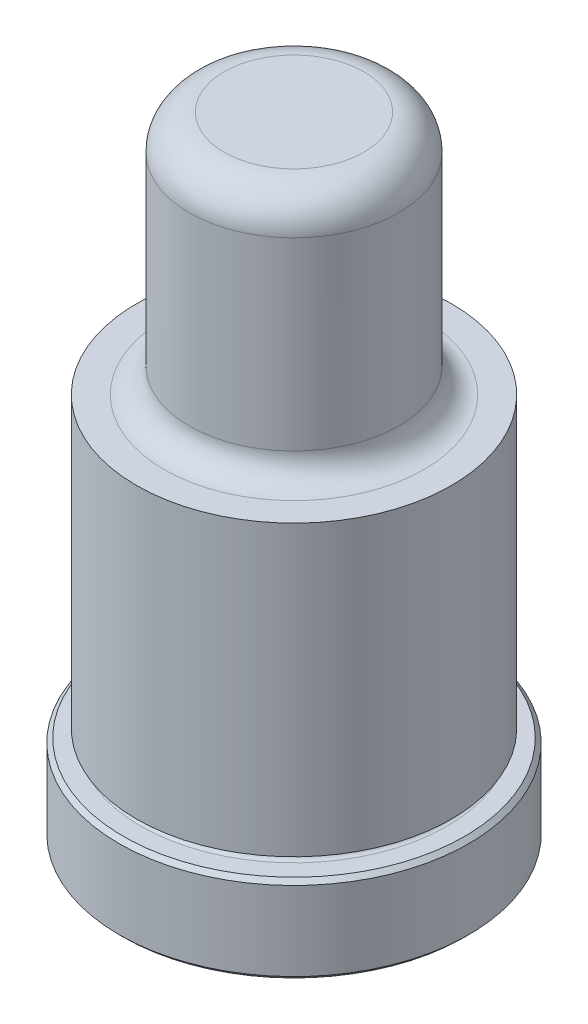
ISO-10303-21;
HEADER;
FILE_DESCRIPTION(('STEP AP214'),'2;1');
FILE_NAME('part.step','',(''),(''),'','','');
FILE_SCHEMA(('AUTOMOTIVE_DESIGN { 1 0 10303 214 1 1 1 1 }'));
ENDSEC;
DATA;
#1=APPLICATION_CONTEXT('core data for automotive mechanical design processes');
#2=APPLICATION_PROTOCOL_DEFINITION('international standard','automotive_design',2000,#1);
#3=PRODUCT_CONTEXT('',#1,'mechanical');
#4=PRODUCT('Part','Part','',(#3));
#5=PRODUCT_RELATED_PRODUCT_CATEGORY('part','',(#4));
#6=PRODUCT_DEFINITION_FORMATION('','',#4);
#7=PRODUCT_DEFINITION_CONTEXT('part definition',#1,'design');
#8=PRODUCT_DEFINITION('design','',#6,#7);
#9=PRODUCT_DEFINITION_SHAPE('','',#8);
#10=(LENGTH_UNIT() NAMED_UNIT(*) SI_UNIT(.MILLI.,.METRE.));
#11=(NAMED_UNIT(*) PLANE_ANGLE_UNIT() SI_UNIT($,.RADIAN.));
#12=(NAMED_UNIT(*) SI_UNIT($,.STERADIAN.) SOLID_ANGLE_UNIT());
#13=UNCERTAINTY_MEASURE_WITH_UNIT(LENGTH_MEASURE(1.E-05),#10,'distance_accuracy_value','');
#14=(GEOMETRIC_REPRESENTATION_CONTEXT(3) GLOBAL_UNCERTAINTY_ASSIGNED_CONTEXT((#13)) GLOBAL_UNIT_ASSIGNED_CONTEXT((#10,
#11,#12)) REPRESENTATION_CONTEXT('',''));
#15=CARTESIAN_POINT('',(0.,0.,0.));
#16=DIRECTION('',(0.,0.,1.));
#17=DIRECTION('',(1.,0.,0.));
#18=AXIS2_PLACEMENT_3D('',#15,#16,#17);
#19=CARTESIAN_POINT('',(0.,0.,0.));
#20=DIRECTION('',(0.,1.,0.));
#21=DIRECTION('',(0.,0.,1.));
#22=AXIS2_PLACEMENT_3D('',#19,#20,#21);
#23=PLANE('',#22);
#24=CARTESIAN_POINT('',(0.,0.,0.));
#25=DIRECTION('',(0.,1.,0.));
#26=DIRECTION('',(0.,0.,1.));
#27=AXIS2_PLACEMENT_3D('',#24,#25,#26);
#28=CIRCLE('',#27,15.494);
#29=CARTESIAN_POINT('',(0.,0.,15.494));
#30=VERTEX_POINT('',#29);
#31=EDGE_CURVE('E46',#30,#30,#28,.F.);
#32=ORIENTED_EDGE('',*,*,#31,.T.);
#33=EDGE_LOOP('',(#32));
#34=FACE_BOUND('',#33,.T.);
#35=ADVANCED_FACE('F31',(#34),#23,.F.);
#36=CARTESIAN_POINT('',(0.,0.,0.));
#37=DIRECTION('',(0.,1.,0.));
#38=DIRECTION('',(0.,0.,1.));
#39=AXIS2_PLACEMENT_3D('',#36,#37,#38);
#40=CYLINDRICAL_SURFACE('',#39,15.875);
#41=CARTESIAN_POINT('',(0.,0.381000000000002,0.));
#42=DIRECTION('',(0.,1.,0.));
#43=DIRECTION('',(0.,0.,1.));
#44=AXIS2_PLACEMENT_3D('',#41,#42,#43);
#45=CIRCLE('',#44,15.875);
#46=CARTESIAN_POINT('',(0.,0.381,15.875));
#47=VERTEX_POINT('',#46);
#48=EDGE_CURVE('E51',#47,#47,#45,.T.);
#49=ORIENTED_EDGE('',*,*,#48,.T.);
#50=EDGE_LOOP('',(#49));
#51=FACE_BOUND('',#50,.T.);
#52=CARTESIAN_POINT('',(0.,7.5438,0.));
#53=DIRECTION('',(0.,-1.,0.));
#54=DIRECTION('',(0.,0.,-1.));
#55=AXIS2_PLACEMENT_3D('',#52,#53,#54);
#56=CIRCLE('',#55,15.875);
#57=CARTESIAN_POINT('',(0.,7.5438,-15.875));
#58=VERTEX_POINT('',#57);
#59=EDGE_CURVE('E54',#58,#58,#56,.T.);
#60=ORIENTED_EDGE('',*,*,#59,.T.);
#61=EDGE_LOOP('',(#60));
#62=FACE_BOUND('',#61,.T.);
#63=ADVANCED_FACE('F110',(#51,#62),#40,.T.);
#64=CARTESIAN_POINT('',(0.,7.9248,-15.875));
#65=DIRECTION('',(0.,-1.,0.));
#66=DIRECTION('',(0.,0.,-1.));
#67=AXIS2_PLACEMENT_3D('',#64,#65,#66);
#68=PLANE('',#67);
#69=CARTESIAN_POINT('',(0.,7.9248,0.));
#70=DIRECTION('',(0.,-1.,0.));
#71=DIRECTION('',(0.,0.,-1.));
#72=AXIS2_PLACEMENT_3D('',#69,#70,#71);
#73=CIRCLE('',#72,15.494);
#74=CARTESIAN_POINT('',(0.,7.9248,-15.494));
#75=VERTEX_POINT('',#74);
#76=EDGE_CURVE('E42',#75,#75,#73,.F.);
#77=ORIENTED_EDGE('',*,*,#76,.T.);
#78=EDGE_LOOP('',(#77));
#79=FACE_BOUND('',#78,.T.);
#80=CARTESIAN_POINT('',(0.,7.9248,0.));
#81=DIRECTION('',(0.,1.,0.));
#82=DIRECTION('',(0.,0.,1.));
#83=AXIS2_PLACEMENT_3D('',#80,#81,#82);
#84=CIRCLE('',#83,13.8938);
#85=CARTESIAN_POINT('',(0.,7.9248,13.8938));
#86=VERTEX_POINT('',#85);
#87=EDGE_CURVE('E57',#86,#86,#84,.T.);
#88=ORIENTED_EDGE('',*,*,#87,.F.);
#89=EDGE_LOOP('',(#88));
#90=FACE_BOUND('',#89,.T.);
#91=ADVANCED_FACE('F105',(#79,#90),#68,.F.);
#92=CARTESIAN_POINT('',(0.,8.3058,0.));
#93=DIRECTION('',(0.,1.,0.));
#94=DIRECTION('',(0.,0.,1.));
#95=AXIS2_PLACEMENT_3D('',#92,#93,#94);
#96=TOROIDAL_SURFACE('',#95,13.8938,0.381000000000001);
#97=CARTESIAN_POINT('',(0.,8.68680000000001,0.));
#98=DIRECTION('',(0.,1.,0.));
#99=DIRECTION('',(0.,0.,1.));
#100=AXIS2_PLACEMENT_3D('',#97,#98,#99);
#101=CIRCLE('',#100,13.8938);
#102=CARTESIAN_POINT('',(0.,8.6868,13.8938));
#103=VERTEX_POINT('',#102);
#104=EDGE_CURVE('E60',#103,#103,#101,.T.);
#105=ORIENTED_EDGE('',*,*,#104,.F.);
#106=EDGE_LOOP('',(#105));
#107=FACE_BOUND('',#106,.T.);
#108=ORIENTED_EDGE('',*,*,#87,.T.);
#109=EDGE_LOOP('',(#108));
#110=FACE_BOUND('',#109,.T.);
#111=ADVANCED_FACE('F99',(#107,#110),#96,.F.);
#112=CARTESIAN_POINT('',(0.,8.68680000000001,-13.8938));
#113=DIRECTION('',(0.,1.,0.));
#114=DIRECTION('',(0.,0.,1.));
#115=AXIS2_PLACEMENT_3D('',#112,#113,#114);
#116=PLANE('',#115);
#117=CARTESIAN_POINT('',(0.,8.6868,0.));
#118=DIRECTION('',(0.,1.,0.));
#119=DIRECTION('',(0.,0.,1.));
#120=AXIS2_PLACEMENT_3D('',#117,#118,#119);
#121=CIRCLE('',#120,14.3002);
#122=CARTESIAN_POINT('',(0.,8.6868,14.3002));
#123=VERTEX_POINT('',#122);
#124=EDGE_CURVE('E63',#123,#123,#121,.T.);
#125=ORIENTED_EDGE('',*,*,#124,.F.);
#126=EDGE_LOOP('',(#125));
#127=FACE_BOUND('',#126,.T.);
#128=ORIENTED_EDGE('',*,*,#104,.T.);
#129=EDGE_LOOP('',(#128));
#130=FACE_BOUND('',#129,.T.);
#131=ADVANCED_FACE('F93',(#127,#130),#116,.F.);
#132=CARTESIAN_POINT('',(0.,0.,0.));
#133=DIRECTION('',(0.,1.,0.));
#134=DIRECTION('',(0.,0.,1.));
#135=AXIS2_PLACEMENT_3D('',#132,#133,#134);
#136=CYLINDRICAL_SURFACE('',#135,14.3002);
#137=CARTESIAN_POINT('',(0.,34.925,0.));
#138=DIRECTION('',(0.,1.,0.));
#139=DIRECTION('',(0.,0.,1.));
#140=AXIS2_PLACEMENT_3D('',#137,#138,#139);
#141=CIRCLE('',#140,14.3002);
#142=CARTESIAN_POINT('',(0.,34.925,14.3002));
#143=VERTEX_POINT('',#142);
#144=EDGE_CURVE('E66',#143,#143,#141,.T.);
#145=ORIENTED_EDGE('',*,*,#144,.F.);
#146=EDGE_LOOP('',(#145));
#147=FACE_BOUND('',#146,.T.);
#148=ORIENTED_EDGE('',*,*,#124,.T.);
#149=EDGE_LOOP('',(#148));
#150=FACE_BOUND('',#149,.T.);
#151=ADVANCED_FACE('F87',(#147,#150),#136,.T.);
#152=CARTESIAN_POINT('',(0.,34.925,-14.3002));
#153=DIRECTION('',(0.,-1.,0.));
#154=DIRECTION('',(0.,0.,-1.));
#155=AXIS2_PLACEMENT_3D('',#152,#153,#154);
#156=PLANE('',#155);
#157=CARTESIAN_POINT('',(0.,34.925,0.));
#158=DIRECTION('',(0.,1.,0.));
#159=DIRECTION('',(0.,0.,1.));
#160=AXIS2_PLACEMENT_3D('',#157,#158,#159);
#161=CIRCLE('',#160,11.7983);
#162=CARTESIAN_POINT('',(0.,34.925,11.7983));
#163=VERTEX_POINT('',#162);
#164=EDGE_CURVE('E69',#163,#163,#161,.T.);
#165=ORIENTED_EDGE('',*,*,#164,.F.);
#166=EDGE_LOOP('',(#165));
#167=FACE_BOUND('',#166,.T.);
#168=ORIENTED_EDGE('',*,*,#144,.T.);
#169=EDGE_LOOP('',(#168));
#170=FACE_BOUND('',#169,.T.);
#171=ADVANCED_FACE('F81',(#167,#170),#156,.F.);
#172=CARTESIAN_POINT('',(0.,37.211,0.));
#173=DIRECTION('',(0.,1.,0.));
#174=DIRECTION('',(0.,0.,1.));
#175=AXIS2_PLACEMENT_3D('',#172,#173,#174);
#176=TOROIDAL_SURFACE('',#175,11.7983,2.28599999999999);
#177=CARTESIAN_POINT('',(0.,37.211,0.));
#178=DIRECTION('',(0.,1.,0.));
#179=DIRECTION('',(0.,0.,1.));
#180=AXIS2_PLACEMENT_3D('',#177,#178,#179);
#181=CIRCLE('',#180,9.51230000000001);
#182=CARTESIAN_POINT('',(0.,37.211,9.51230000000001));
#183=VERTEX_POINT('',#182);
#184=EDGE_CURVE('E72',#183,#183,#181,.T.);
#185=ORIENTED_EDGE('',*,*,#184,.F.);
#186=EDGE_LOOP('',(#185));
#187=FACE_BOUND('',#186,.T.);
#188=ORIENTED_EDGE('',*,*,#164,.T.);
#189=EDGE_LOOP('',(#188));
#190=FACE_BOUND('',#189,.T.);
#191=ADVANCED_FACE('F78',(#187,#190),#176,.F.);
#192=CARTESIAN_POINT('',(0.,0.,0.));
#193=DIRECTION('',(0.,1.,0.));
#194=DIRECTION('',(0.,0.,1.));
#195=AXIS2_PLACEMENT_3D('',#192,#193,#194);
#196=CYLINDRICAL_SURFACE('',#195,9.51230000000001);
#197=CARTESIAN_POINT('',(0.,53.975,0.));
#198=DIRECTION('',(0.,-1.,0.));
#199=DIRECTION('',(0.,0.,-1.));
#200=AXIS2_PLACEMENT_3D('',#197,#198,#199);
#201=CIRCLE('',#200,9.51230000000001);
#202=CARTESIAN_POINT('',(0.,53.975,-9.5123));
#203=VERTEX_POINT('',#202);
#204=EDGE_CURVE('E10',#203,#203,#201,.T.);
#205=ORIENTED_EDGE('',*,*,#204,.T.);
#206=EDGE_LOOP('',(#205));
#207=FACE_BOUND('',#206,.T.);
#208=ORIENTED_EDGE('',*,*,#184,.T.);
#209=EDGE_LOOP('',(#208));
#210=FACE_BOUND('',#209,.T.);
#211=ADVANCED_FACE('F76',(#207,#210),#196,.T.);
#212=CARTESIAN_POINT('',(0.,57.15,-9.5123));
#213=DIRECTION('',(0.,-1.,0.));
#214=DIRECTION('',(0.,0.,-1.));
#215=AXIS2_PLACEMENT_3D('',#212,#213,#214);
#216=PLANE('',#215);
#217=CARTESIAN_POINT('',(0.,57.15,0.));
#218=DIRECTION('',(0.,-1.,0.));
#219=DIRECTION('',(0.,0.,-1.));
#220=AXIS2_PLACEMENT_3D('',#217,#218,#219);
#221=CIRCLE('',#220,6.33730000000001);
#222=CARTESIAN_POINT('',(0.,57.15,-6.3373));
#223=VERTEX_POINT('',#222);
#224=EDGE_CURVE('E38',#223,#223,#221,.F.);
#225=ORIENTED_EDGE('',*,*,#224,.T.);
#226=EDGE_LOOP('',(#225));
#227=FACE_BOUND('',#226,.T.);
#228=ADVANCED_FACE('F127',(#227),#216,.F.);
#229=CARTESIAN_POINT('',(0.,0.381000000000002,0.));
#230=DIRECTION('',(0.,1.,0.));
#231=DIRECTION('',(0.,0.,1.));
#232=AXIS2_PLACEMENT_3D('',#229,#230,#231);
#233=CONICAL_SURFACE('',#232,15.875,0.785398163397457);
#234=ORIENTED_EDGE('',*,*,#31,.F.);
#235=EDGE_LOOP('',(#234));
#236=FACE_BOUND('',#235,.T.);
#237=ORIENTED_EDGE('',*,*,#48,.F.);
#238=EDGE_LOOP('',(#237));
#239=FACE_BOUND('',#238,.T.);
#240=ADVANCED_FACE('F124',(#236,#239),#233,.T.);
#241=CARTESIAN_POINT('',(0.,7.9248,0.));
#242=DIRECTION('',(0.,-1.,0.));
#243=DIRECTION('',(0.,0.,-1.));
#244=AXIS2_PLACEMENT_3D('',#241,#242,#243);
#245=CONICAL_SURFACE('',#244,15.494,0.785398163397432);
#246=ORIENTED_EDGE('',*,*,#59,.F.);
#247=EDGE_LOOP('',(#246));
#248=FACE_BOUND('',#247,.T.);
#249=ORIENTED_EDGE('',*,*,#76,.F.);
#250=EDGE_LOOP('',(#249));
#251=FACE_BOUND('',#250,.T.);
#252=ADVANCED_FACE('F126',(#248,#251),#245,.T.);
#253=CARTESIAN_POINT('',(0.,53.975,0.));
#254=DIRECTION('',(0.,-1.,0.));
#255=DIRECTION('',(0.,0.,-1.));
#256=AXIS2_PLACEMENT_3D('',#253,#254,#255);
#257=TOROIDAL_SURFACE('',#256,6.33730000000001,3.175);
#258=ORIENTED_EDGE('',*,*,#204,.F.);
#259=EDGE_LOOP('',(#258));
#260=FACE_BOUND('',#259,.T.);
#261=ORIENTED_EDGE('',*,*,#224,.F.);
#262=EDGE_LOOP('',(#261));
#263=FACE_BOUND('',#262,.T.);
#264=ADVANCED_FACE('F33',(#260,#263),#257,.T.);
#265=CLOSED_SHELL('',(#35,#63,#91,#111,#131,#151,#171,#191,#211,#228,#240,#252,#264));
#266=MANIFOLD_SOLID_BREP('B2',#265);
#267=ADVANCED_BREP_SHAPE_REPRESENTATION('',(#18,#266),#14);
#268=SHAPE_DEFINITION_REPRESENTATION(#9,#267);
ENDSEC;
END-ISO-10303-21;
